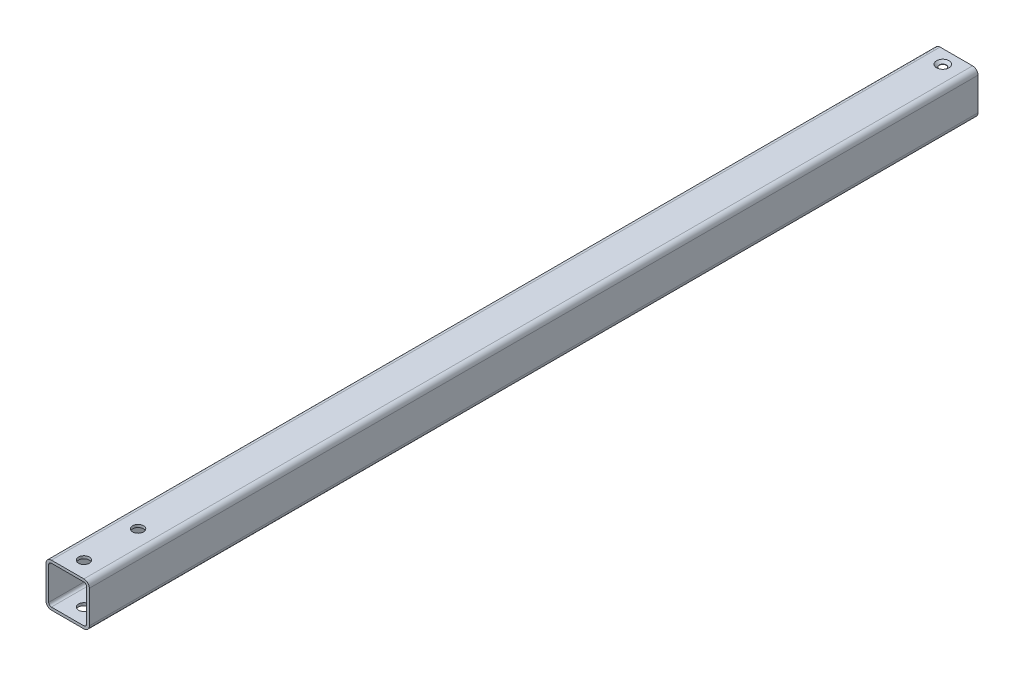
from build123d import *

# Parameters (mm, degrees)
SKETCH1_W           = 25.4
SKETCH1_H           = 25.4
SKETCH1_W_2         = 22.2504
SKETCH1_H_2         = 22.2504
EXTRUDE_THIN1_DEPTH = 520.7
FILLET1_R           = 3.175
FILLET2_R           = 1.5748
SKETCH2_R           = 2.0574
CUT_EXTRUDE1_DEPTH  = 25.4
CHAMFER1_SIZE       = 1.5748
CHAMFER1_SIZE2      = 1.368952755
SKETCH3_R           = 3.175
CUT_EXTRUDE2_DEPTH  = 25.4


with BuildPart() as part:
    # Sketch1 → Extrude-Thin1 (new body)
    with BuildSketch(Plane.XY):
        Rectangle(SKETCH1_W, SKETCH1_H)
        Rectangle(SKETCH1_W_2, SKETCH1_H_2, mode=Mode.SUBTRACT)
    extrude(amount=EXTRUDE_THIN1_DEPTH)

    # Fillet1
    fillet1_edges = [part.edges().sort_by_distance(p)[0] for p in [
        (-12.7, 12.7, 260.35),
        (12.7, 12.7, 260.35),
        (12.7, -12.7, 260.35),
        (-12.7, -12.7, 260.35),
    ]]
    fillet(fillet1_edges, radius=FILLET1_R)

    # Fillet2
    fillet2_edges = [part.edges().sort_by_distance(p)[0] for p in [
        (-11.1252, 11.1252, 260.35),
        (-11.1252, -11.1252, 260.35),
        (11.1252, -11.1252, 260.35),
        (11.1252, 11.1252, 260.35),
    ]]
    fillet(fillet2_edges, radius=FILLET2_R)

    # Sketch2 → Cut-Extrude1 (cut)
    with BuildSketch(Plane(origin=(0, 0, 0), x_dir=(1, 0, 0), z_dir=(0, 1, 0))):
        with Locations((0, -7.9248)):
            Circle(SKETCH2_R)
    extrude(amount=CUT_EXTRUDE1_DEPTH, mode=Mode.SUBTRACT)

    # Chamfer1
    chamfer1_edges = [part.edges().sort_by_distance(p)[0] for p in [
        (-2.0574, 12.7, 7.9248),
    ]]
    chamfer1_side = [part.faces().sort_by_distance(p)[0] for p in [
        (0, 12.7, 260.688859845),
    ]]
    chamfer(chamfer1_edges, length=CHAMFER1_SIZE, length2=CHAMFER1_SIZE2, reference=chamfer1_side[0])

    # Sketch3 → Cut-Extrude2 (cut, symmetric)
    with BuildSketch(Plane(origin=(0, 0, 0), x_dir=(1, 0, 0), z_dir=(0, 1, 0))):
        with Locations(Location((0, -511.175, 0), (0, 0, 270))):
            Circle(SKETCH3_R)
        with Locations(Location((0, -479.425, 0), (0, 0, 270))):
            Circle(SKETCH3_R)
    extrude(amount=CUT_EXTRUDE2_DEPTH, both=True, mode=Mode.SUBTRACT)


solid = part.part
